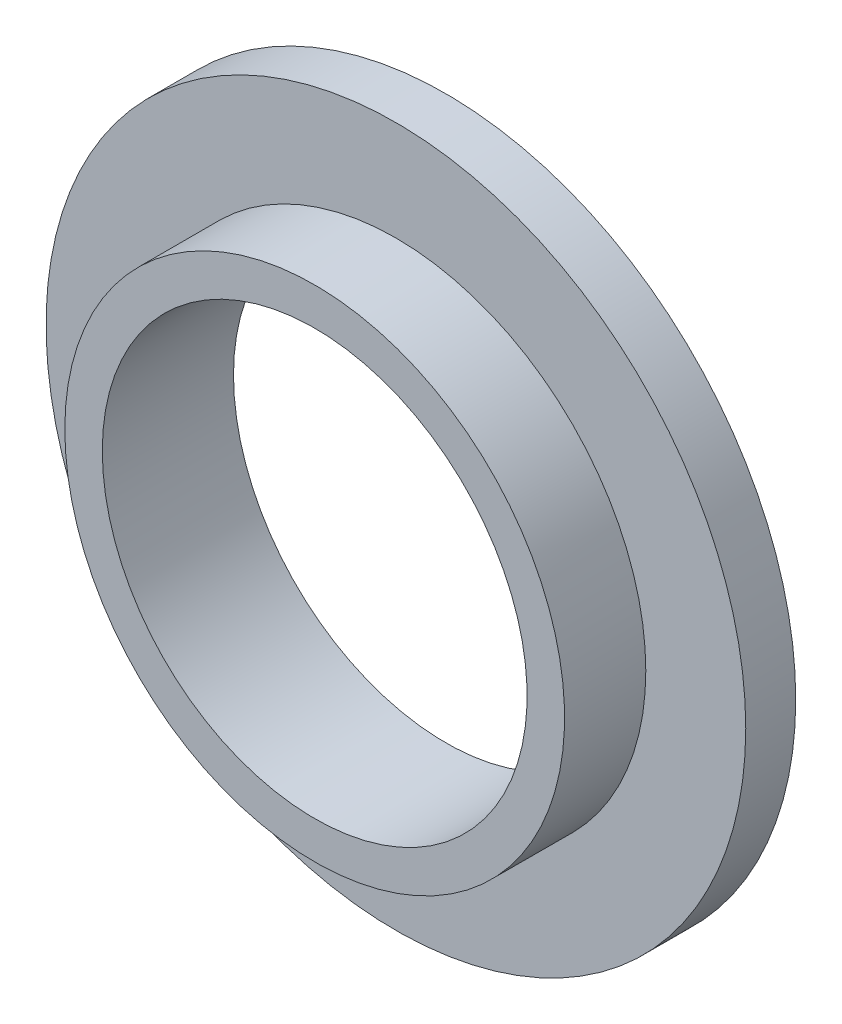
ISO-10303-21;
HEADER;
FILE_DESCRIPTION(('STEP AP214'),'2;1');
FILE_NAME('part.step','',(''),(''),'','','');
FILE_SCHEMA(('AUTOMOTIVE_DESIGN { 1 0 10303 214 1 1 1 1 }'));
ENDSEC;
DATA;
#1=APPLICATION_CONTEXT('core data for automotive mechanical design processes');
#2=APPLICATION_PROTOCOL_DEFINITION('international standard','automotive_design',2000,#1);
#3=PRODUCT_CONTEXT('',#1,'mechanical');
#4=PRODUCT('Part','Part','',(#3));
#5=PRODUCT_RELATED_PRODUCT_CATEGORY('part','',(#4));
#6=PRODUCT_DEFINITION_FORMATION('','',#4);
#7=PRODUCT_DEFINITION_CONTEXT('part definition',#1,'design');
#8=PRODUCT_DEFINITION('design','',#6,#7);
#9=PRODUCT_DEFINITION_SHAPE('','',#8);
#10=(LENGTH_UNIT() NAMED_UNIT(*) SI_UNIT(.MILLI.,.METRE.));
#11=(NAMED_UNIT(*) PLANE_ANGLE_UNIT() SI_UNIT($,.RADIAN.));
#12=(NAMED_UNIT(*) SI_UNIT($,.STERADIAN.) SOLID_ANGLE_UNIT());
#13=UNCERTAINTY_MEASURE_WITH_UNIT(LENGTH_MEASURE(1.E-05),#10,'distance_accuracy_value','');
#14=(GEOMETRIC_REPRESENTATION_CONTEXT(3) GLOBAL_UNCERTAINTY_ASSIGNED_CONTEXT((#13)) GLOBAL_UNIT_ASSIGNED_CONTEXT((#10,
#11,#12)) REPRESENTATION_CONTEXT('',''));
#15=CARTESIAN_POINT('',(0.,0.,0.));
#16=DIRECTION('',(0.,0.,1.));
#17=DIRECTION('',(1.,0.,0.));
#18=AXIS2_PLACEMENT_3D('',#15,#16,#17);
#19=CARTESIAN_POINT('',(0.,0.,2.));
#20=DIRECTION('',(0.,0.,1.));
#21=DIRECTION('',(1.,0.,0.));
#22=AXIS2_PLACEMENT_3D('',#19,#20,#21);
#23=PLANE('',#22);
#24=CARTESIAN_POINT('',(0.,0.,2.));
#25=DIRECTION('',(0.,0.,1.));
#26=DIRECTION('',(1.,0.,0.));
#27=AXIS2_PLACEMENT_3D('',#24,#25,#26);
#28=CIRCLE('',#27,14.);
#29=CARTESIAN_POINT('',(14.,0.,2.));
#30=VERTEX_POINT('',#29);
#31=EDGE_CURVE('E10',#30,#30,#28,.T.);
#32=ORIENTED_EDGE('',*,*,#31,.T.);
#33=EDGE_LOOP('',(#32));
#34=FACE_BOUND('',#33,.T.);
#35=CARTESIAN_POINT('',(0.,0.,2.));
#36=DIRECTION('',(0.,0.,1.));
#37=DIRECTION('',(1.,0.,0.));
#38=AXIS2_PLACEMENT_3D('',#35,#36,#37);
#39=CIRCLE('',#38,10.);
#40=CARTESIAN_POINT('',(10.,0.,2.));
#41=VERTEX_POINT('',#40);
#42=EDGE_CURVE('E47',#41,#41,#39,.T.);
#43=ORIENTED_EDGE('',*,*,#42,.F.);
#44=EDGE_LOOP('',(#43));
#45=FACE_BOUND('',#44,.T.);
#46=ADVANCED_FACE('F29',(#34,#45),#23,.T.);
#47=CARTESIAN_POINT('',(0.,0.,0.));
#48=DIRECTION('',(0.,0.,1.));
#49=DIRECTION('',(1.,0.,0.));
#50=AXIS2_PLACEMENT_3D('',#47,#48,#49);
#51=PLANE('',#50);
#52=CARTESIAN_POINT('',(0.,0.,0.));
#53=DIRECTION('',(0.,0.,1.));
#54=DIRECTION('',(1.,0.,0.));
#55=AXIS2_PLACEMENT_3D('',#52,#53,#54);
#56=CIRCLE('',#55,14.);
#57=CARTESIAN_POINT('',(14.,0.,0.));
#58=VERTEX_POINT('',#57);
#59=EDGE_CURVE('E33',#58,#58,#56,.T.);
#60=ORIENTED_EDGE('',*,*,#59,.F.);
#61=EDGE_LOOP('',(#60));
#62=FACE_BOUND('',#61,.T.);
#63=CARTESIAN_POINT('',(0.,0.,0.));
#64=DIRECTION('',(0.,0.,1.));
#65=DIRECTION('',(1.,0.,0.));
#66=AXIS2_PLACEMENT_3D('',#63,#64,#65);
#67=CIRCLE('',#66,8.5);
#68=CARTESIAN_POINT('',(8.5,0.,0.));
#69=VERTEX_POINT('',#68);
#70=EDGE_CURVE('E40',#69,#69,#67,.T.);
#71=ORIENTED_EDGE('',*,*,#70,.T.);
#72=EDGE_LOOP('',(#71));
#73=FACE_BOUND('',#72,.T.);
#74=ADVANCED_FACE('F57',(#62,#73),#51,.F.);
#75=CARTESIAN_POINT('',(0.,0.,2.));
#76=DIRECTION('',(0.,0.,-1.));
#77=DIRECTION('',(-1.,0.,0.));
#78=AXIS2_PLACEMENT_3D('',#75,#76,#77);
#79=CYLINDRICAL_SURFACE('',#78,14.);
#80=ORIENTED_EDGE('',*,*,#31,.F.);
#81=EDGE_LOOP('',(#80));
#82=FACE_BOUND('',#81,.T.);
#83=ORIENTED_EDGE('',*,*,#59,.T.);
#84=EDGE_LOOP('',(#83));
#85=FACE_BOUND('',#84,.T.);
#86=ADVANCED_FACE('F31',(#82,#85),#79,.T.);
#87=CARTESIAN_POINT('',(0.,0.,2.));
#88=DIRECTION('',(0.,0.,-1.));
#89=DIRECTION('',(-1.,0.,0.));
#90=AXIS2_PLACEMENT_3D('',#87,#88,#89);
#91=CYLINDRICAL_SURFACE('',#90,8.5);
#92=ORIENTED_EDGE('',*,*,#70,.F.);
#93=EDGE_LOOP('',(#92));
#94=FACE_BOUND('',#93,.T.);
#95=CARTESIAN_POINT('',(0.,0.,5.24999999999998));
#96=DIRECTION('',(0.,0.,-1.));
#97=DIRECTION('',(-1.,0.,0.));
#98=AXIS2_PLACEMENT_3D('',#95,#96,#97);
#99=CIRCLE('',#98,8.5);
#100=CARTESIAN_POINT('',(-8.5,0.,5.24999999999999));
#101=VERTEX_POINT('',#100);
#102=EDGE_CURVE('E44',#101,#101,#99,.T.);
#103=ORIENTED_EDGE('',*,*,#102,.F.);
#104=EDGE_LOOP('',(#103));
#105=FACE_BOUND('',#104,.T.);
#106=ADVANCED_FACE('F64',(#94,#105),#91,.F.);
#107=CARTESIAN_POINT('',(0.,0.,33.5342712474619));
#108=DIRECTION('',(0.,0.,-1.));
#109=DIRECTION('',(-1.,0.,0.));
#110=AXIS2_PLACEMENT_3D('',#107,#108,#109);
#111=CYLINDRICAL_SURFACE('',#110,10.);
#112=CARTESIAN_POINT('',(0.,0.,5.24999999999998));
#113=DIRECTION('',(0.,0.,-1.));
#114=DIRECTION('',(-1.,0.,0.));
#115=AXIS2_PLACEMENT_3D('',#112,#113,#114);
#116=CIRCLE('',#115,10.);
#117=CARTESIAN_POINT('',(-10.,0.,5.24999999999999));
#118=VERTEX_POINT('',#117);
#119=EDGE_CURVE('E48',#118,#118,#116,.T.);
#120=ORIENTED_EDGE('',*,*,#119,.T.);
#121=EDGE_LOOP('',(#120));
#122=FACE_BOUND('',#121,.T.);
#123=ORIENTED_EDGE('',*,*,#42,.T.);
#124=EDGE_LOOP('',(#123));
#125=FACE_BOUND('',#124,.T.);
#126=ADVANCED_FACE('F54',(#122,#125),#111,.T.);
#127=CARTESIAN_POINT('',(0.149349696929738,0.43729266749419,5.24999999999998));
#128=DIRECTION('',(0.,0.,-1.));
#129=DIRECTION('',(-0.32320247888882,-0.946329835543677,0.));
#130=AXIS2_PLACEMENT_3D('',#127,#128,#129);
#131=PLANE('',#130);
#132=ORIENTED_EDGE('',*,*,#102,.T.);
#133=EDGE_LOOP('',(#132));
#134=FACE_BOUND('',#133,.T.);
#135=ORIENTED_EDGE('',*,*,#119,.F.);
#136=EDGE_LOOP('',(#135));
#137=FACE_BOUND('',#136,.T.);
#138=ADVANCED_FACE('F68',(#134,#137),#131,.F.);
#139=CLOSED_SHELL('',(#46,#74,#86,#106,#126,#138));
#140=MANIFOLD_SOLID_BREP('B2',#139);
#141=ADVANCED_BREP_SHAPE_REPRESENTATION('',(#18,#140),#14);
#142=SHAPE_DEFINITION_REPRESENTATION(#9,#141);
ENDSEC;
END-ISO-10303-21;
